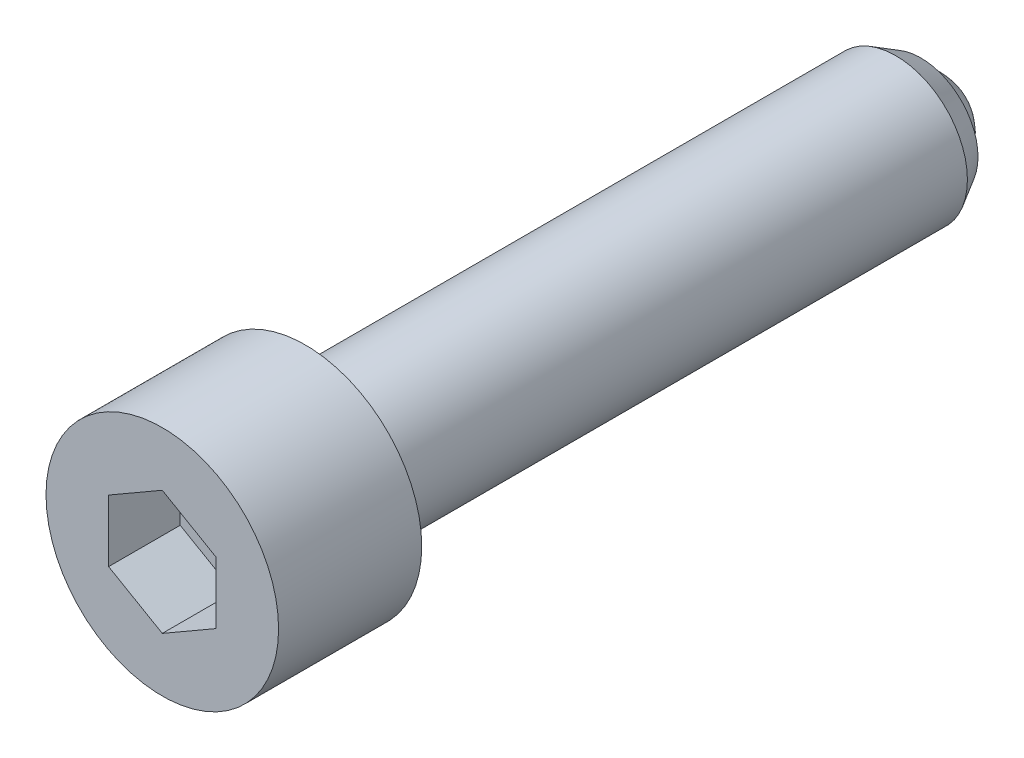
ISO-10303-21;
HEADER;
FILE_DESCRIPTION(('STEP AP214'),'2;1');
FILE_NAME('part.step','',(''),(''),'','','');
FILE_SCHEMA(('AUTOMOTIVE_DESIGN { 1 0 10303 214 1 1 1 1 }'));
ENDSEC;
DATA;
#1=APPLICATION_CONTEXT('core data for automotive mechanical design processes');
#2=APPLICATION_PROTOCOL_DEFINITION('international standard','automotive_design',2000,#1);
#3=PRODUCT_CONTEXT('',#1,'mechanical');
#4=PRODUCT('Part','Part','',(#3));
#5=PRODUCT_RELATED_PRODUCT_CATEGORY('part','',(#4));
#6=PRODUCT_DEFINITION_FORMATION('','',#4);
#7=PRODUCT_DEFINITION_CONTEXT('part definition',#1,'design');
#8=PRODUCT_DEFINITION('design','',#6,#7);
#9=PRODUCT_DEFINITION_SHAPE('','',#8);
#10=(LENGTH_UNIT() NAMED_UNIT(*) SI_UNIT(.MILLI.,.METRE.));
#11=(NAMED_UNIT(*) PLANE_ANGLE_UNIT() SI_UNIT($,.RADIAN.));
#12=(NAMED_UNIT(*) SI_UNIT($,.STERADIAN.) SOLID_ANGLE_UNIT());
#13=UNCERTAINTY_MEASURE_WITH_UNIT(LENGTH_MEASURE(1.E-05),#10,'distance_accuracy_value','');
#14=(GEOMETRIC_REPRESENTATION_CONTEXT(3) GLOBAL_UNCERTAINTY_ASSIGNED_CONTEXT((#13)) GLOBAL_UNIT_ASSIGNED_CONTEXT((#10,
#11,#12)) REPRESENTATION_CONTEXT('',''));
#15=CARTESIAN_POINT('',(0.,0.,0.));
#16=DIRECTION('',(0.,0.,1.));
#17=DIRECTION('',(1.,0.,0.));
#18=AXIS2_PLACEMENT_3D('',#15,#16,#17);
#19=CARTESIAN_POINT('',(0.,0.,2.75));
#20=DIRECTION('',(0.,0.,-1.));
#21=DIRECTION('',(1.,0.,0.));
#22=AXIS2_PLACEMENT_3D('',#19,#20,#21);
#23=SPHERICAL_SURFACE('',#22,2.75);
#24=CARTESIAN_POINT('',(0.,0.,1.90165736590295));
#25=DIRECTION('',(0.,0.,-1.));
#26=DIRECTION('',(1.,0.,0.));
#27=AXIS2_PLACEMENT_3D('',#24,#25,#26);
#28=CIRCLE('',#27,2.61587743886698);
#29=CARTESIAN_POINT('',(2.61587743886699,0.,1.90165736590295));
#30=VERTEX_POINT('',#29);
#31=EDGE_CURVE('E9',#30,#30,#28,.T.);
#32=ORIENTED_EDGE('',*,*,#31,.T.);
#33=EDGE_LOOP('',(#32));
#34=FACE_BOUND('',#33,.T.);
#35=ADVANCED_FACE('F15',(#34),#23,.T.);
#36=CARTESIAN_POINT('',(3.19170962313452,0.,1.90165736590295));
#37=DIRECTION('',(0.,0.,1.));
#38=DIRECTION('',(-1.,0.,0.));
#39=AXIS2_PLACEMENT_3D('',#36,#37,#38);
#40=PLANE('',#39);
#41=ORIENTED_EDGE('',*,*,#31,.F.);
#42=EDGE_LOOP('',(#41));
#43=FACE_BOUND('',#42,.T.);
#44=CARTESIAN_POINT('',(0.,0.,1.90165736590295));
#45=DIRECTION('',(0.,0.,-1.));
#46=DIRECTION('',(1.,0.,0.));
#47=AXIS2_PLACEMENT_3D('',#44,#45,#46);
#48=CIRCLE('',#47,3.19170962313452);
#49=CARTESIAN_POINT('',(3.19170962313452,0.,1.90165736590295));
#50=VERTEX_POINT('',#49);
#51=EDGE_CURVE('E22',#50,#50,#48,.T.);
#52=ORIENTED_EDGE('',*,*,#51,.T.);
#53=EDGE_LOOP('',(#52));
#54=FACE_BOUND('',#53,.T.);
#55=ADVANCED_FACE('F136',(#43,#54),#40,.F.);
#56=CARTESIAN_POINT('',(0.,0.,3.301657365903));
#57=DIRECTION('',(0.,0.,1.));
#58=DIRECTION('',(-1.,0.,0.));
#59=AXIS2_PLACEMENT_3D('',#56,#57,#58);
#60=CONICAL_SURFACE('',#59,4.,0.523598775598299);
#61=ORIENTED_EDGE('',*,*,#51,.F.);
#62=EDGE_LOOP('',(#61));
#63=FACE_BOUND('',#62,.T.);
#64=CARTESIAN_POINT('',(0.,0.,3.301657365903));
#65=DIRECTION('',(0.,0.,-1.));
#66=DIRECTION('',(1.,0.,0.));
#67=AXIS2_PLACEMENT_3D('',#64,#65,#66);
#68=CIRCLE('',#67,4.);
#69=CARTESIAN_POINT('',(4.,0.,3.301657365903));
#70=VERTEX_POINT('',#69);
#71=EDGE_CURVE('E131',#70,#70,#68,.T.);
#72=ORIENTED_EDGE('',*,*,#71,.T.);
#73=EDGE_LOOP('',(#72));
#74=FACE_BOUND('',#73,.T.);
#75=ADVANCED_FACE('F138',(#63,#74),#60,.T.);
#76=CARTESIAN_POINT('',(0.,0.,6.3));
#77=DIRECTION('',(0.,0.,-1.));
#78=DIRECTION('',(1.,0.,0.));
#79=AXIS2_PLACEMENT_3D('',#76,#77,#78);
#80=CYLINDRICAL_SURFACE('',#79,4.);
#81=ORIENTED_EDGE('',*,*,#71,.F.);
#82=EDGE_LOOP('',(#81));
#83=FACE_BOUND('',#82,.T.);
#84=CARTESIAN_POINT('',(0.,0.,36.3));
#85=DIRECTION('',(0.,0.,-1.));
#86=DIRECTION('',(1.,0.,0.));
#87=AXIS2_PLACEMENT_3D('',#84,#85,#86);
#88=CIRCLE('',#87,4.);
#89=CARTESIAN_POINT('',(4.,0.,36.3));
#90=VERTEX_POINT('',#89);
#91=EDGE_CURVE('E128',#90,#90,#88,.T.);
#92=ORIENTED_EDGE('',*,*,#91,.T.);
#93=EDGE_LOOP('',(#92));
#94=FACE_BOUND('',#93,.T.);
#95=ADVANCED_FACE('F141',(#83,#94),#80,.T.);
#96=CARTESIAN_POINT('',(4.,0.,36.3));
#97=DIRECTION('',(0.,0.,-1.));
#98=DIRECTION('',(1.,0.,0.));
#99=AXIS2_PLACEMENT_3D('',#96,#97,#98);
#100=PLANE('',#99);
#101=CARTESIAN_POINT('',(0.,0.,36.3));
#102=DIRECTION('',(0.,0.,-1.));
#103=DIRECTION('',(1.,0.,0.));
#104=AXIS2_PLACEMENT_3D('',#101,#102,#103);
#105=CIRCLE('',#104,6.5);
#106=CARTESIAN_POINT('',(6.5,0.,36.3));
#107=VERTEX_POINT('',#106);
#108=EDGE_CURVE('E125',#107,#107,#105,.T.);
#109=ORIENTED_EDGE('',*,*,#108,.T.);
#110=EDGE_LOOP('',(#109));
#111=FACE_BOUND('',#110,.T.);
#112=ORIENTED_EDGE('',*,*,#91,.F.);
#113=EDGE_LOOP('',(#112));
#114=FACE_BOUND('',#113,.T.);
#115=ADVANCED_FACE('F147',(#111,#114),#100,.T.);
#116=CARTESIAN_POINT('',(0.,0.,6.3));
#117=DIRECTION('',(0.,0.,-1.));
#118=DIRECTION('',(1.,0.,0.));
#119=AXIS2_PLACEMENT_3D('',#116,#117,#118);
#120=CYLINDRICAL_SURFACE('',#119,6.5);
#121=CARTESIAN_POINT('',(0.,0.,44.3));
#122=DIRECTION('',(0.,0.,-1.));
#123=DIRECTION('',(1.,0.,0.));
#124=AXIS2_PLACEMENT_3D('',#121,#122,#123);
#125=CIRCLE('',#124,6.5);
#126=CARTESIAN_POINT('',(6.5,0.,44.3));
#127=VERTEX_POINT('',#126);
#128=EDGE_CURVE('E122',#127,#127,#125,.T.);
#129=ORIENTED_EDGE('',*,*,#128,.T.);
#130=EDGE_LOOP('',(#129));
#131=FACE_BOUND('',#130,.T.);
#132=ORIENTED_EDGE('',*,*,#108,.F.);
#133=EDGE_LOOP('',(#132));
#134=FACE_BOUND('',#133,.T.);
#135=ADVANCED_FACE('F152',(#131,#134),#120,.T.);
#136=CARTESIAN_POINT('',(6.5,0.,44.3));
#137=DIRECTION('',(0.,0.,1.));
#138=DIRECTION('',(-1.,0.,0.));
#139=AXIS2_PLACEMENT_3D('',#136,#137,#138);
#140=PLANE('',#139);
#141=DIRECTION('',(-0.86602540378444,0.5,0.));
#142=VECTOR('',#141,1.);
#143=CARTESIAN_POINT('',(3.,1.73205080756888,44.3));
#144=LINE('',#143,#142);
#145=CARTESIAN_POINT('',(3.,1.73205080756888,44.3));
#146=VERTEX_POINT('',#145);
#147=CARTESIAN_POINT('',(0.,3.46410161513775,44.3));
#148=VERTEX_POINT('',#147);
#149=EDGE_CURVE('E29',#146,#148,#144,.T.);
#150=ORIENTED_EDGE('',*,*,#149,.F.);
#151=DIRECTION('',(0.,1.,0.));
#152=VECTOR('',#151,1.);
#153=CARTESIAN_POINT('',(3.,-1.73205080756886,44.3));
#154=LINE('',#153,#152);
#155=CARTESIAN_POINT('',(3.,-1.73205080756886,44.3));
#156=VERTEX_POINT('',#155);
#157=EDGE_CURVE('E98',#156,#146,#154,.T.);
#158=ORIENTED_EDGE('',*,*,#157,.F.);
#159=DIRECTION('',(-0.866025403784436,-0.5,0.));
#160=VECTOR('',#159,1.);
#161=CARTESIAN_POINT('',(3.,-1.73205080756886,44.3));
#162=LINE('',#161,#160);
#163=CARTESIAN_POINT('',(0.,-3.46410161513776,44.3));
#164=VERTEX_POINT('',#163);
#165=EDGE_CURVE('E93',#156,#164,#162,.T.);
#166=ORIENTED_EDGE('',*,*,#165,.T.);
#167=DIRECTION('',(0.866025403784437,-0.5,0.));
#168=VECTOR('',#167,1.);
#169=CARTESIAN_POINT('',(-3.,-1.73205080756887,44.3));
#170=LINE('',#169,#168);
#171=CARTESIAN_POINT('',(-3.,-1.73205080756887,44.3));
#172=VERTEX_POINT('',#171);
#173=EDGE_CURVE('E91',#172,#164,#170,.T.);
#174=ORIENTED_EDGE('',*,*,#173,.F.);
#175=DIRECTION('',(0.,1.,0.));
#176=VECTOR('',#175,1.);
#177=CARTESIAN_POINT('',(-3.,-1.73205080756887,44.3));
#178=LINE('',#177,#176);
#179=CARTESIAN_POINT('',(-3.,1.73205080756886,44.3));
#180=VERTEX_POINT('',#179);
#181=EDGE_CURVE('E72',#172,#180,#178,.T.);
#182=ORIENTED_EDGE('',*,*,#181,.T.);
#183=DIRECTION('',(0.866025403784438,0.5,0.));
#184=VECTOR('',#183,1.);
#185=CARTESIAN_POINT('',(-3.,1.73205080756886,44.3));
#186=LINE('',#185,#184);
#187=EDGE_CURVE('E83',#180,#148,#186,.T.);
#188=ORIENTED_EDGE('',*,*,#187,.T.);
#189=EDGE_LOOP('',(#150,#158,#166,#174,#182,#188));
#190=FACE_BOUND('',#189,.T.);
#191=ORIENTED_EDGE('',*,*,#128,.F.);
#192=EDGE_LOOP('',(#191));
#193=FACE_BOUND('',#192,.T.);
#194=ADVANCED_FACE('F87',(#190,#193),#140,.T.);
#195=CARTESIAN_POINT('',(3.,1.73205080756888,40.3));
#196=DIRECTION('',(0.5,0.86602540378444,0.));
#197=DIRECTION('',(0.86602540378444,-0.5,0.));
#198=AXIS2_PLACEMENT_3D('',#195,#196,#197);
#199=PLANE('',#198);
#200=DIRECTION('',(0.,0.,1.));
#201=VECTOR('',#200,1.);
#202=CARTESIAN_POINT('',(3.,1.73205080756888,40.3));
#203=LINE('',#202,#201);
#204=CARTESIAN_POINT('',(3.,1.73205080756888,40.3));
#205=VERTEX_POINT('',#204);
#206=EDGE_CURVE('E36',#205,#146,#203,.T.);
#207=ORIENTED_EDGE('',*,*,#206,.T.);
#208=ORIENTED_EDGE('',*,*,#149,.T.);
#209=DIRECTION('',(0.,0.,1.));
#210=VECTOR('',#209,1.);
#211=CARTESIAN_POINT('',(0.,3.46410161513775,40.3));
#212=LINE('',#211,#210);
#213=CARTESIAN_POINT('',(0.,3.46410161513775,40.3));
#214=VERTEX_POINT('',#213);
#215=EDGE_CURVE('E80',#214,#148,#212,.T.);
#216=ORIENTED_EDGE('',*,*,#215,.F.);
#217=DIRECTION('',(-0.86602540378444,0.5,0.));
#218=VECTOR('',#217,1.);
#219=CARTESIAN_POINT('',(3.,1.73205080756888,40.3));
#220=LINE('',#219,#218);
#221=EDGE_CURVE('E100',#205,#214,#220,.T.);
#222=ORIENTED_EDGE('',*,*,#221,.F.);
#223=EDGE_LOOP('',(#207,#208,#216,#222));
#224=FACE_BOUND('',#223,.T.);
#225=ADVANCED_FACE('F206',(#224),#199,.F.);
#226=CARTESIAN_POINT('',(3.,-1.73205080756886,40.3));
#227=DIRECTION('',(1.,0.,0.));
#228=DIRECTION('',(0.,-1.,0.));
#229=AXIS2_PLACEMENT_3D('',#226,#227,#228);
#230=PLANE('',#229);
#231=DIRECTION('',(0.,0.,1.));
#232=VECTOR('',#231,1.);
#233=CARTESIAN_POINT('',(3.,-1.73205080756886,40.3));
#234=LINE('',#233,#232);
#235=CARTESIAN_POINT('',(3.,-1.73205080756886,40.3));
#236=VERTEX_POINT('',#235);
#237=EDGE_CURVE('E119',#236,#156,#234,.T.);
#238=ORIENTED_EDGE('',*,*,#237,.T.);
#239=ORIENTED_EDGE('',*,*,#157,.T.);
#240=ORIENTED_EDGE('',*,*,#206,.F.);
#241=DIRECTION('',(0.,1.,0.));
#242=VECTOR('',#241,1.);
#243=CARTESIAN_POINT('',(3.,-1.73205080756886,40.3));
#244=LINE('',#243,#242);
#245=EDGE_CURVE('E112',#236,#205,#244,.T.);
#246=ORIENTED_EDGE('',*,*,#245,.F.);
#247=EDGE_LOOP('',(#238,#239,#240,#246));
#248=FACE_BOUND('',#247,.T.);
#249=ADVANCED_FACE('F215',(#248),#230,.F.);
#250=CARTESIAN_POINT('',(3.,-1.73205080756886,40.3));
#251=DIRECTION('',(-0.5,0.866025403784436,0.));
#252=DIRECTION('',(0.866025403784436,0.5,0.));
#253=AXIS2_PLACEMENT_3D('',#250,#251,#252);
#254=PLANE('',#253);
#255=DIRECTION('',(0.,0.,1.));
#256=VECTOR('',#255,1.);
#257=CARTESIAN_POINT('',(0.,-3.46410161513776,40.3));
#258=LINE('',#257,#256);
#259=CARTESIAN_POINT('',(0.,-3.46410161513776,40.3));
#260=VERTEX_POINT('',#259);
#261=EDGE_CURVE('E117',#260,#164,#258,.T.);
#262=ORIENTED_EDGE('',*,*,#261,.T.);
#263=ORIENTED_EDGE('',*,*,#165,.F.);
#264=ORIENTED_EDGE('',*,*,#237,.F.);
#265=DIRECTION('',(-0.866025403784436,-0.5,0.));
#266=VECTOR('',#265,1.);
#267=CARTESIAN_POINT('',(3.,-1.73205080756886,40.3));
#268=LINE('',#267,#266);
#269=EDGE_CURVE('E109',#236,#260,#268,.T.);
#270=ORIENTED_EDGE('',*,*,#269,.T.);
#271=EDGE_LOOP('',(#262,#263,#264,#270));
#272=FACE_BOUND('',#271,.T.);
#273=ADVANCED_FACE('F224',(#272),#254,.T.);
#274=CARTESIAN_POINT('',(-3.,-1.73205080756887,40.3));
#275=DIRECTION('',(-0.5,-0.866025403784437,0.));
#276=DIRECTION('',(-0.866025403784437,0.5,0.));
#277=AXIS2_PLACEMENT_3D('',#274,#275,#276);
#278=PLANE('',#277);
#279=DIRECTION('',(0.,0.,1.));
#280=VECTOR('',#279,1.);
#281=CARTESIAN_POINT('',(-3.,-1.73205080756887,40.3));
#282=LINE('',#281,#280);
#283=CARTESIAN_POINT('',(-3.,-1.73205080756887,40.3));
#284=VERTEX_POINT('',#283);
#285=EDGE_CURVE('E79',#284,#172,#282,.T.);
#286=ORIENTED_EDGE('',*,*,#285,.T.);
#287=ORIENTED_EDGE('',*,*,#173,.T.);
#288=ORIENTED_EDGE('',*,*,#261,.F.);
#289=DIRECTION('',(0.866025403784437,-0.5,0.));
#290=VECTOR('',#289,1.);
#291=CARTESIAN_POINT('',(-3.,-1.73205080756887,40.3));
#292=LINE('',#291,#290);
#293=EDGE_CURVE('E106',#284,#260,#292,.T.);
#294=ORIENTED_EDGE('',*,*,#293,.F.);
#295=EDGE_LOOP('',(#286,#287,#288,#294));
#296=FACE_BOUND('',#295,.T.);
#297=ADVANCED_FACE('F233',(#296),#278,.F.);
#298=CARTESIAN_POINT('',(-3.,-1.73205080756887,40.3));
#299=DIRECTION('',(1.,0.,0.));
#300=DIRECTION('',(0.,-1.,0.));
#301=AXIS2_PLACEMENT_3D('',#298,#299,#300);
#302=PLANE('',#301);
#303=DIRECTION('',(0.,0.,1.));
#304=VECTOR('',#303,1.);
#305=CARTESIAN_POINT('',(-3.,1.73205080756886,40.3));
#306=LINE('',#305,#304);
#307=CARTESIAN_POINT('',(-3.,1.73205080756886,40.3));
#308=VERTEX_POINT('',#307);
#309=EDGE_CURVE('E68',#308,#180,#306,.T.);
#310=ORIENTED_EDGE('',*,*,#309,.T.);
#311=ORIENTED_EDGE('',*,*,#181,.F.);
#312=ORIENTED_EDGE('',*,*,#285,.F.);
#313=DIRECTION('',(0.,1.,0.));
#314=VECTOR('',#313,1.);
#315=CARTESIAN_POINT('',(-3.,-1.73205080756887,40.3));
#316=LINE('',#315,#314);
#317=EDGE_CURVE('E75',#284,#308,#316,.T.);
#318=ORIENTED_EDGE('',*,*,#317,.T.);
#319=EDGE_LOOP('',(#310,#311,#312,#318));
#320=FACE_BOUND('',#319,.T.);
#321=ADVANCED_FACE('F70',(#320),#302,.T.);
#322=CARTESIAN_POINT('',(-3.,1.73205080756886,40.3));
#323=DIRECTION('',(0.5,-0.866025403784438,0.));
#324=DIRECTION('',(-0.866025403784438,-0.5,0.));
#325=AXIS2_PLACEMENT_3D('',#322,#323,#324);
#326=PLANE('',#325);
#327=DIRECTION('',(0.866025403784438,0.5,0.));
#328=VECTOR('',#327,1.);
#329=CARTESIAN_POINT('',(-3.,1.73205080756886,40.3));
#330=LINE('',#329,#328);
#331=EDGE_CURVE('E103',#308,#214,#330,.T.);
#332=ORIENTED_EDGE('',*,*,#331,.T.);
#333=ORIENTED_EDGE('',*,*,#215,.T.);
#334=ORIENTED_EDGE('',*,*,#187,.F.);
#335=ORIENTED_EDGE('',*,*,#309,.F.);
#336=EDGE_LOOP('',(#332,#333,#334,#335));
#337=FACE_BOUND('',#336,.T.);
#338=ADVANCED_FACE('F84',(#337),#326,.T.);
#339=CARTESIAN_POINT('',(6.,0.,40.3));
#340=DIRECTION('',(0.,0.,1.));
#341=DIRECTION('',(-1.,0.,0.));
#342=AXIS2_PLACEMENT_3D('',#339,#340,#341);
#343=PLANE('',#342);
#344=ORIENTED_EDGE('',*,*,#221,.T.);
#345=ORIENTED_EDGE('',*,*,#331,.F.);
#346=ORIENTED_EDGE('',*,*,#317,.F.);
#347=ORIENTED_EDGE('',*,*,#293,.T.);
#348=ORIENTED_EDGE('',*,*,#269,.F.);
#349=ORIENTED_EDGE('',*,*,#245,.T.);
#350=EDGE_LOOP('',(#344,#345,#346,#347,#348,#349));
#351=FACE_BOUND('',#350,.T.);
#352=ADVANCED_FACE('F253',(#351),#343,.T.);
#353=CLOSED_SHELL('',(#35,#55,#75,#95,#115,#135,#194,#225,#249,#273,#297,#321,#338,#352));
#354=MANIFOLD_SOLID_BREP('B1',#353);
#355=ADVANCED_BREP_SHAPE_REPRESENTATION('',(#18,#354),#14);
#356=SHAPE_DEFINITION_REPRESENTATION(#9,#355);
ENDSEC;
END-ISO-10303-21;
